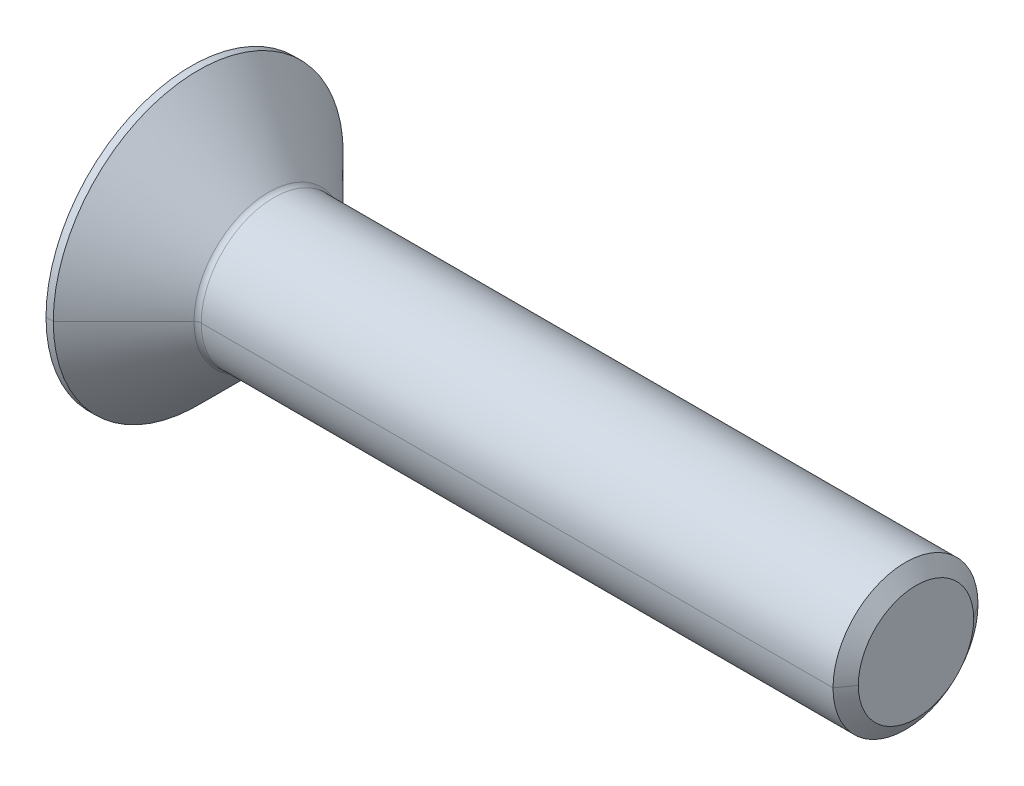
ISO-10303-21;
HEADER;
FILE_DESCRIPTION(('STEP AP214'),'2;1');
FILE_NAME('part.step','',(''),(''),'','','');
FILE_SCHEMA(('AUTOMOTIVE_DESIGN { 1 0 10303 214 1 1 1 1 }'));
ENDSEC;
DATA;
#1=APPLICATION_CONTEXT('core data for automotive mechanical design processes');
#2=APPLICATION_PROTOCOL_DEFINITION('international standard','automotive_design',2000,#1);
#3=PRODUCT_CONTEXT('',#1,'mechanical');
#4=PRODUCT('Part','Part','',(#3));
#5=PRODUCT_RELATED_PRODUCT_CATEGORY('part','',(#4));
#6=PRODUCT_DEFINITION_FORMATION('','',#4);
#7=PRODUCT_DEFINITION_CONTEXT('part definition',#1,'design');
#8=PRODUCT_DEFINITION('design','',#6,#7);
#9=PRODUCT_DEFINITION_SHAPE('','',#8);
#10=(LENGTH_UNIT() NAMED_UNIT(*) SI_UNIT(.MILLI.,.METRE.));
#11=(NAMED_UNIT(*) PLANE_ANGLE_UNIT() SI_UNIT($,.RADIAN.));
#12=(NAMED_UNIT(*) SI_UNIT($,.STERADIAN.) SOLID_ANGLE_UNIT());
#13=UNCERTAINTY_MEASURE_WITH_UNIT(LENGTH_MEASURE(1.E-05),#10,'distance_accuracy_value','');
#14=(GEOMETRIC_REPRESENTATION_CONTEXT(3) GLOBAL_UNCERTAINTY_ASSIGNED_CONTEXT((#13)) GLOBAL_UNIT_ASSIGNED_CONTEXT((#10,
#11,#12)) REPRESENTATION_CONTEXT('',''));
#15=CARTESIAN_POINT('',(0.,0.,0.));
#16=DIRECTION('',(0.,0.,1.));
#17=DIRECTION('',(1.,0.,0.));
#18=AXIS2_PLACEMENT_3D('',#15,#16,#17);
#19=CARTESIAN_POINT('',(3.060145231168,0.,0.));
#20=DIRECTION('',(-1.,0.,0.));
#21=DIRECTION('',(0.,0.,-1.));
#22=AXIS2_PLACEMENT_3D('',#19,#20,#21);
#23=CONICAL_SURFACE('',#22,1.0098,1.0471975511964);
#24=DIRECTION('',(0.500000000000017,0.,0.866025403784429));
#25=VECTOR('',#24,1.);
#26=CARTESIAN_POINT('',(2.5,0.,-1.98));
#27=LINE('',#26,#25);
#28=CARTESIAN_POINT('',(2.5,0.,-1.98));
#29=VERTEX_POINT('',#28);
#30=CARTESIAN_POINT('',(3.643153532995,0.,0.));
#31=VERTEX_POINT('',#30);
#32=EDGE_CURVE('E25',#29,#31,#27,.T.);
#33=ORIENTED_EDGE('',*,*,#32,.F.);
#34=CARTESIAN_POINT('',(2.5,0.,0.));
#35=DIRECTION('',(1.,0.,0.));
#36=DIRECTION('',(0.,0.,1.));
#37=AXIS2_PLACEMENT_3D('',#34,#35,#36);
#38=CIRCLE('',#37,1.98);
#39=CARTESIAN_POINT('',(2.5,0.,1.98));
#40=VERTEX_POINT('',#39);
#41=EDGE_CURVE('E204',#40,#29,#38,.T.);
#42=ORIENTED_EDGE('',*,*,#41,.F.);
#43=DIRECTION('',(-0.500000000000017,0.,0.866025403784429));
#44=VECTOR('',#43,1.);
#45=CARTESIAN_POINT('',(3.643153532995,0.,0.));
#46=LINE('',#45,#44);
#47=EDGE_CURVE('E11',#31,#40,#46,.T.);
#48=ORIENTED_EDGE('',*,*,#47,.F.);
#49=EDGE_LOOP('',(#33,#42,#48));
#50=FACE_BOUND('',#49,.T.);
#51=ADVANCED_FACE('F16',(#50),#23,.F.);
#52=CARTESIAN_POINT('',(3.060145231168,0.,0.));
#53=DIRECTION('',(-1.,0.,0.));
#54=DIRECTION('',(0.,0.,-1.));
#55=AXIS2_PLACEMENT_3D('',#52,#53,#54);
#56=CONICAL_SURFACE('',#55,1.0098,1.0471975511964);
#57=CARTESIAN_POINT('',(2.5,0.,0.));
#58=DIRECTION('',(1.,0.,0.));
#59=DIRECTION('',(0.,0.,-1.));
#60=AXIS2_PLACEMENT_3D('',#57,#58,#59);
#61=CIRCLE('',#60,1.98);
#62=EDGE_CURVE('E270',#29,#40,#61,.T.);
#63=ORIENTED_EDGE('',*,*,#62,.F.);
#64=ORIENTED_EDGE('',*,*,#32,.T.);
#65=ORIENTED_EDGE('',*,*,#47,.T.);
#66=EDGE_LOOP('',(#63,#64,#65));
#67=FACE_BOUND('',#66,.T.);
#68=ADVANCED_FACE('F385',(#67),#56,.F.);
#69=CARTESIAN_POINT('',(2.5,0.,0.));
#70=DIRECTION('',(1.,0.,0.));
#71=DIRECTION('',(0.,1.,0.));
#72=AXIS2_PLACEMENT_3D('',#69,#70,#71);
#73=PLANE('',#72);
#74=ORIENTED_EDGE('',*,*,#62,.T.);
#75=ORIENTED_EDGE('',*,*,#41,.T.);
#76=EDGE_LOOP('',(#74,#75));
#77=FACE_BOUND('',#76,.T.);
#78=DIRECTION('',(0.,-0.498487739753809,-0.866896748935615));
#79=VECTOR('',#78,1.);
#80=CARTESIAN_POINT('',(2.5,2.30939755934,0.004030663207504));
#81=LINE('',#80,#79);
#82=CARTESIAN_POINT('',(2.5,2.30939755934,0.004030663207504));
#83=VERTEX_POINT('',#82);
#84=CARTESIAN_POINT('',(2.5,1.158189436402,-1.997981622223));
#85=VERTEX_POINT('',#84);
#86=EDGE_CURVE('E294',#83,#85,#81,.T.);
#87=ORIENTED_EDGE('',*,*,#86,.T.);
#88=DIRECTION('',(0.,0.999998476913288,0.00174532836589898));
#89=VECTOR('',#88,1.);
#90=CARTESIAN_POINT('',(2.5,-1.151208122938,-2.00201228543));
#91=LINE('',#90,#89);
#92=CARTESIAN_POINT('',(2.5,-1.151208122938,-2.00201228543));
#93=VERTEX_POINT('',#92);
#94=EDGE_CURVE('E300',#93,#85,#91,.T.);
#95=ORIENTED_EDGE('',*,*,#94,.F.);
#96=DIRECTION('',(0.,-0.501510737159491,0.865151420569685));
#97=VECTOR('',#96,1.);
#98=CARTESIAN_POINT('',(2.5,-1.151208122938,-2.00201228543));
#99=LINE('',#98,#97);
#100=CARTESIAN_POINT('',(2.5,-2.30939755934,-0.004030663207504));
#101=VERTEX_POINT('',#100);
#102=EDGE_CURVE('E289',#93,#101,#99,.T.);
#103=ORIENTED_EDGE('',*,*,#102,.T.);
#104=DIRECTION('',(0.,0.498487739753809,0.866896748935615));
#105=VECTOR('',#104,1.);
#106=CARTESIAN_POINT('',(2.5,-2.30939755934,-0.004030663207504));
#107=LINE('',#106,#105);
#108=CARTESIAN_POINT('',(2.5,-1.158189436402,1.997981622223));
#109=VERTEX_POINT('',#108);
#110=EDGE_CURVE('E284',#101,#109,#107,.T.);
#111=ORIENTED_EDGE('',*,*,#110,.T.);
#112=DIRECTION('',(0.,-0.999998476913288,-0.00174532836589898));
#113=VECTOR('',#112,1.);
#114=CARTESIAN_POINT('',(2.5,1.151208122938,2.00201228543));
#115=LINE('',#114,#113);
#116=CARTESIAN_POINT('',(2.5,1.151208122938,2.00201228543));
#117=VERTEX_POINT('',#116);
#118=EDGE_CURVE('E279',#117,#109,#115,.T.);
#119=ORIENTED_EDGE('',*,*,#118,.F.);
#120=DIRECTION('',(0.,0.501510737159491,-0.865151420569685));
#121=VECTOR('',#120,1.);
#122=CARTESIAN_POINT('',(2.5,1.151208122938,2.00201228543));
#123=LINE('',#122,#121);
#124=EDGE_CURVE('E274',#117,#83,#123,.T.);
#125=ORIENTED_EDGE('',*,*,#124,.T.);
#126=EDGE_LOOP('',(#87,#95,#103,#111,#119,#125));
#127=FACE_BOUND('',#126,.T.);
#128=ADVANCED_FACE('F389',(#77,#127),#73,.F.);
#129=CARTESIAN_POINT('',(0.,1.151208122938,2.00201228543));
#130=DIRECTION('',(0.,0.865151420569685,0.501510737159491));
#131=DIRECTION('',(1.,0.,0.));
#132=AXIS2_PLACEMENT_3D('',#129,#130,#131);
#133=PLANE('',#132);
#134=DIRECTION('',(-1.,0.,0.));
#135=VECTOR('',#134,1.);
#136=CARTESIAN_POINT('',(2.5,2.30939755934,0.004030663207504));
#137=LINE('',#136,#135);
#138=CARTESIAN_POINT('',(0.1154700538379,2.30939755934,0.004030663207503));
#139=VERTEX_POINT('',#138);
#140=EDGE_CURVE('E298',#83,#139,#137,.T.);
#141=ORIENTED_EDGE('',*,*,#140,.F.);
#142=ORIENTED_EDGE('',*,*,#124,.F.);
#143=DIRECTION('',(-1.,0.,0.));
#144=VECTOR('',#143,1.);
#145=CARTESIAN_POINT('',(2.5,1.151208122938,2.00201228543));
#146=LINE('',#145,#144);
#147=CARTESIAN_POINT('',(0.1154700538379,1.151208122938,2.00201228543));
#148=VERTEX_POINT('',#147);
#149=EDGE_CURVE('E278',#117,#148,#146,.T.);
#150=ORIENTED_EDGE('',*,*,#149,.T.);
#151=CARTESIAN_POINT('',(0.115470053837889,2.30939755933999,0.0040306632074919));
#152=CARTESIAN_POINT('',(0.141210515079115,2.28356961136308,0.0485812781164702));
#153=CARTESIAN_POINT('',(0.165955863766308,2.25746357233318,0.0935754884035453));
#154=CARTESIAN_POINT('',(0.212028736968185,2.20575204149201,0.182695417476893));
#155=CARTESIAN_POINT('',(0.233453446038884,2.18016836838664,0.226783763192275));
#156=CARTESIAN_POINT('',(0.272900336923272,2.12937758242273,0.314363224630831));
#157=CARTESIAN_POINT('',(0.291014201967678,2.10418778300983,0.357822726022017));
#158=CARTESIAN_POINT('',(0.323835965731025,2.05402056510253,0.444434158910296));
#159=CARTESIAN_POINT('',(0.338621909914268,2.02905544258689,0.487563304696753));
#160=CARTESIAN_POINT('',(0.357878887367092,1.9923503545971,0.550897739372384));
#161=CARTESIAN_POINT('',(0.363591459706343,1.98078967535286,0.570834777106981));
#162=CARTESIAN_POINT('',(0.374247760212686,1.9577491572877,0.610545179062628));
#163=CARTESIAN_POINT('',(0.379201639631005,1.94627066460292,0.630316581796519));
#164=CARTESIAN_POINT('',(0.388338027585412,1.92338378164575,0.669742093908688));
#165=CARTESIAN_POINT('',(0.392529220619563,1.91197624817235,0.689394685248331));
#166=CARTESIAN_POINT('',(0.400142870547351,1.88921252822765,0.728625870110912));
#167=CARTESIAN_POINT('',(0.403572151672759,1.87785685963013,0.748203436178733));
#168=CARTESIAN_POINT('',(0.409663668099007,1.8551752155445,0.787327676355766));
#169=CARTESIAN_POINT('',(0.412330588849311,1.84384950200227,0.806873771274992));
#170=CARTESIAN_POINT('',(0.416899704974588,1.82120180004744,0.845976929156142));
#171=CARTESIAN_POINT('',(0.418804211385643,1.80987990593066,0.86553377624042));
#172=CARTESIAN_POINT('',(0.421850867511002,1.78720997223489,0.904699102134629));
#173=CARTESIAN_POINT('',(0.422992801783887,1.77586192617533,0.924307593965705));
#174=CARTESIAN_POINT('',(0.424517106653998,1.75310557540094,0.9636151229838));
#175=CARTESIAN_POINT('',(0.424896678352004,1.74169720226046,0.98331422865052));
#176=CARTESIAN_POINT('',(0.424898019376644,1.71886872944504,1.02269273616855));
#177=CARTESIAN_POINT('',(0.42452016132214,1.70744863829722,1.04237214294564));
#178=CARTESIAN_POINT('',(0.422998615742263,1.68465671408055,1.08163682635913));
#179=CARTESIAN_POINT('',(0.421857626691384,1.67328485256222,1.10122219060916));
#180=CARTESIAN_POINT('',(0.418812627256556,1.65057185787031,1.14034755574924));
#181=CARTESIAN_POINT('',(0.416908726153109,1.63923072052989,1.15988756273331));
#182=CARTESIAN_POINT('',(0.412340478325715,1.61655822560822,1.19896867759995));
#183=CARTESIAN_POINT('',(0.409673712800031,1.60522701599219,1.21850958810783));
#184=CARTESIAN_POINT('',(0.403582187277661,1.58255017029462,1.25763636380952));
#185=CARTESIAN_POINT('',(0.400152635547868,1.57120491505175,1.27722170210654));
#186=CARTESIAN_POINT('',(0.39253814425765,1.54847247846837,1.3164783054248));
#187=CARTESIAN_POINT('',(0.388346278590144,1.53708593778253,1.33614859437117));
#188=CARTESIAN_POINT('',(0.37920812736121,1.51424198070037,1.37561387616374));
#189=CARTESIAN_POINT('',(0.374253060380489,1.50278545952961,1.39540735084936));
#190=CARTESIAN_POINT('',(0.363594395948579,1.47976556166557,1.43515238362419));
#191=CARTESIAN_POINT('',(0.35788056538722,1.46820320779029,1.45510177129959));
#192=CARTESIAN_POINT('',(0.338627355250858,1.43148053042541,1.51842810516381));
#193=CARTESIAN_POINT('',(0.323847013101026,1.40646402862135,1.56151652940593));
#194=CARTESIAN_POINT('',(0.291032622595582,1.35624218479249,1.64808120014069));
#195=CARTESIAN_POINT('',(0.272920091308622,1.33105065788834,1.69153537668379));
#196=CARTESIAN_POINT('',(0.233472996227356,1.28029606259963,1.77913505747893));
#197=CARTESIAN_POINT('',(0.212046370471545,1.25475192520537,1.82324971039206));
#198=CARTESIAN_POINT('',(0.165966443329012,1.20311152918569,1.91242615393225));
#199=CARTESIAN_POINT('',(0.141215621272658,1.17703691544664,1.95745029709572));
#200=CARTESIAN_POINT('',(0.115470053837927,1.15120812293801,2.00201228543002));
#201=B_SPLINE_CURVE_WITH_KNOTS('',3,(#151,#152,#153,#154,#155,#156,#157,#158,#159,#160,#161,
#162,#163,#164,#165,#166,#167,#168,#169,#170,#171,#172,#173,#174,#175,#176,#177,#178,#179,#180,
#181,#182,#183,#184,#185,#186,#187,#188,#189,#190,#191,#192,#193,#194,#195,#196,#197,#198,#199,
#200),.UNSPECIFIED.,.F.,.F.,(4,2,2,2,2,2,2,2,2,2,2,2,2,2,2,2,2,2,2,2,2,2,2,2,4),(0.,
0.17273613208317,0.338555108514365,0.498670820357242,0.654510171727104,0.725733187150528,
0.795899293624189,0.865208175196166,0.933868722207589,1.00209773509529,1.07011833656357,
1.13815814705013,1.20644730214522,1.27470287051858,1.3427183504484,1.41072409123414,
1.4789478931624,1.54761302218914,1.61693638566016,1.68712694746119,1.75838443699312,
1.91419169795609,2.07429538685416,2.24012471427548,2.41289531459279),.UNSPECIFIED.);
#202=EDGE_CURVE('E217',#139,#148,#201,.T.);
#203=ORIENTED_EDGE('',*,*,#202,.F.);
#204=EDGE_LOOP('',(#141,#142,#150,#203));
#205=FACE_BOUND('',#204,.T.);
#206=ADVANCED_FACE('F334',(#205),#133,.F.);
#207=CARTESIAN_POINT('',(0.213377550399,0.,0.));
#208=DIRECTION('',(-1.,0.,0.));
#209=DIRECTION('',(0.,0.,-1.));
#210=AXIS2_PLACEMENT_3D('',#207,#208,#209);
#211=CONICAL_SURFACE('',#210,2.211493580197,0.785398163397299);
#212=CARTESIAN_POINT('',(0.4248680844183,0.,-2.000003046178));
#213=CARTESIAN_POINT('',(0.4249597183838,0.0525023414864,-1.999911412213));
#214=CARTESIAN_POINT('',(0.4209923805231,0.1577455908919,-1.999727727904));
#215=CARTESIAN_POINT('',(0.402657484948,0.3158357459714,-1.999451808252));
#216=CARTESIAN_POINT('',(0.3718845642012,0.4756221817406,-1.999172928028));
#217=CARTESIAN_POINT('',(0.3287264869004,0.6374714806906,-1.998890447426));
#218=CARTESIAN_POINT('',(0.2727299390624,0.8034092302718,-1.998600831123));
#219=CARTESIAN_POINT('',(0.2031200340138,0.9753855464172,-1.998300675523));
#220=CARTESIAN_POINT('',(0.1463878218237,1.096353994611,-1.998089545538));
#221=CARTESIAN_POINT('',(0.1154700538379,1.158189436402,-1.997981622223));
#222=(BOUNDED_CURVE() B_SPLINE_CURVE(3,(#212,#213,#214,#215,#216,#217,#218,#219,#220,#221),
.UNSPECIFIED.,.F.,.F.) B_SPLINE_CURVE_WITH_KNOTS((4,1,1,1,1,1,1,4),(0.,0.1428571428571,
0.2857142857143,0.4285714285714,0.5714285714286,0.7142857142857,0.8571428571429,1.),
.UNSPECIFIED.) CURVE() GEOMETRIC_REPRESENTATION_ITEM() RATIONAL_B_SPLINE_CURVE((1.,1.,1.,1.,1.,
1.,1.,1.,1.,1.)) REPRESENTATION_ITEM(''));
#223=CARTESIAN_POINT('',(0.4248680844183,0.,-2.000003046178));
#224=VERTEX_POINT('',#223);
#225=CARTESIAN_POINT('',(0.1154700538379,1.158189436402,-1.997981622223));
#226=VERTEX_POINT('',#225);
#227=EDGE_CURVE('E303',#224,#226,#222,.T.);
#228=ORIENTED_EDGE('',*,*,#227,.T.);
#229=CARTESIAN_POINT('',(0.115470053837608,1.15818943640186,-1.99798162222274));
#230=CARTESIAN_POINT('',(0.14121051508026,1.18385742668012,-1.9533386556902));
#231=CARTESIAN_POINT('',(0.165955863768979,1.20977053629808,-1.90823305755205));
#232=CARTESIAN_POINT('',(0.212028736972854,1.2610948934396,-1.81888959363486));
#233=CARTESIAN_POINT('',(0.233453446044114,1.28648468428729,-1.7746893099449));
#234=CARTESIAN_POINT('',(0.272900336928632,1.33693532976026,-1.68691346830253));
#235=CARTESIAN_POINT('',(0.29101420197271,1.3619774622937,-1.64336871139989));
#236=CARTESIAN_POINT('',(0.323835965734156,1.41190155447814,-1.55661690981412));
#237=CARTESIAN_POINT('',(0.338621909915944,1.43676992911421,-1.51343190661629));
#238=CARTESIAN_POINT('',(0.357878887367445,1.47326661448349,-1.44997715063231));
#239=CARTESIAN_POINT('',(0.363591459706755,1.48475225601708,-1.42999678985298));
#240=CARTESIAN_POINT('',(0.374247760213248,1.50762221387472,-1.3901879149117));
#241=CARTESIAN_POINT('',(0.379201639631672,1.51900550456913,-1.37036154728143));
#242=CARTESIAN_POINT('',(0.388338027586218,1.54170555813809,-1.3308281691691));
#243=CARTESIAN_POINT('',(0.392529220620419,1.55302143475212,-1.31112265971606));
#244=CARTESIAN_POINT('',(0.400142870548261,1.57561477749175,-1.27179310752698));
#245=CARTESIAN_POINT('',(0.403572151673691,1.58689161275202,-1.25217002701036));
#246=CARTESIAN_POINT('',(0.409663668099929,1.60943337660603,-1.21296502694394));
#247=CARTESIAN_POINT('',(0.41233058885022,1.62069793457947,-1.19338362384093));
#248=CARTESIAN_POINT('',(0.416899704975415,1.6432384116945,-1.15421855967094));
#249=CARTESIAN_POINT('',(0.41880421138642,1.65451419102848,-1.13463508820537));
#250=CARTESIAN_POINT('',(0.421850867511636,1.67709739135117,-1.09541968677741));
#251=CARTESIAN_POINT('',(0.422992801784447,1.68840482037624,-1.07578774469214));
#252=CARTESIAN_POINT('',(0.424517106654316,1.71106796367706,-1.0364264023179));
#253=CARTESIAN_POINT('',(0.424896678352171,1.72242370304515,-1.01669690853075));
#254=CARTESIAN_POINT('',(0.424898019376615,1.74511225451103,-0.977237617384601));
#255=CARTESIAN_POINT('',(0.424520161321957,1.75644507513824,-0.957507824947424));
#256=CARTESIAN_POINT('',(0.422998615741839,1.77905332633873,-0.918137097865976));
#257=CARTESIAN_POINT('',(0.421857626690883,1.79032881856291,-0.898496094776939));
#258=CARTESIAN_POINT('',(0.418812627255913,1.81285588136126,-0.859263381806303));
#259=CARTESIAN_POINT('',(0.416908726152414,1.8241074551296,-0.839671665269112));
#260=CARTESIAN_POINT('',(0.412340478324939,1.84661644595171,-0.800496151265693));
#261=CARTESIAN_POINT('',(0.409673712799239,1.8578737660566,-0.780912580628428));
#262=CARTESIAN_POINT('',(0.40358218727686,1.8804201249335,-0.74171046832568));
#263=CARTESIAN_POINT('',(0.400152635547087,1.89170889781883,-0.722092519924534));
#264=CARTESIAN_POINT('',(0.392538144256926,1.91433989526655,-0.682777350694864));
#265=CARTESIAN_POINT('',(0.38834627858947,1.92568159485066,-0.663081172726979));
#266=CARTESIAN_POINT('',(0.379208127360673,1.94843755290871,-0.623565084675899));
#267=CARTESIAN_POINT('',(0.374253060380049,1.95985094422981,-0.603746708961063));
#268=CARTESIAN_POINT('',(0.36359439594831,1.98276120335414,-0.563938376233));
#269=CARTESIAN_POINT('',(0.357880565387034,1.99425670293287,-0.543950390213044));
#270=CARTESIAN_POINT('',(0.338627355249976,2.03073757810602,-0.480484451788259));
#271=CARTESIAN_POINT('',(0.323847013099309,2.05554499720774,-0.437275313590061));
#272=CARTESIAN_POINT('',(0.291032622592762,2.10540127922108,-0.35049958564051));
#273=CARTESIAN_POINT('',(0.272920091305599,2.13043793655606,-0.306955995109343));
#274=CARTESIAN_POINT('',(0.233472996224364,2.18092418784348,-0.219201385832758));
#275=CARTESIAN_POINT('',(0.212046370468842,2.20635652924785,-0.1750221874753));
#276=CARTESIAN_POINT('',(0.165966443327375,2.25776539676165,-0.0857120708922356));
#277=CARTESIAN_POINT('',(0.141215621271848,2.28372014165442,-0.0406187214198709));
#278=CARTESIAN_POINT('',(0.115470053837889,2.30939755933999,0.0040306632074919));
#279=B_SPLINE_CURVE_WITH_KNOTS('',3,(#229,#230,#231,#232,#233,#234,#235,#236,#237,#238,#239,
#240,#241,#242,#243,#244,#245,#246,#247,#248,#249,#250,#251,#252,#253,#254,#255,#256,#257,#258,
#259,#260,#261,#262,#263,#264,#265,#266,#267,#268,#269,#270,#271,#272,#273,#274,#275,#276,#277,
#278),.UNSPECIFIED.,.F.,.F.,(4,2,2,2,2,2,2,2,2,2,2,2,2,2,2,2,2,2,2,2,2,2,2,2,4),(0.,
0.172736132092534,0.338555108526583,0.498670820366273,0.654510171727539,0.725733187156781,
0.795899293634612,0.865208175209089,0.933868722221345,1.00209773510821,1.07011833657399,
1.1381581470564,1.20644730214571,1.27470287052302,1.3427183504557,1.41072409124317,
1.47894789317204,1.54761302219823,1.61693638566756,1.68712694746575,1.7583844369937,
1.91419169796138,2.07429538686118,2.24012471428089,2.41289531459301),.UNSPECIFIED.);
#280=EDGE_CURVE('E304',#226,#139,#279,.T.);
#281=ORIENTED_EDGE('',*,*,#280,.T.);
#282=ORIENTED_EDGE('',*,*,#202,.T.);
#283=CARTESIAN_POINT('',(0.1154700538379,1.151208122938,2.00201228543));
#284=CARTESIAN_POINT('',(0.146194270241,1.089759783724,2.001905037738));
#285=CARTESIAN_POINT('',(0.2026006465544,0.9695372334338,2.001695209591));
#286=CARTESIAN_POINT('',(0.271908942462,0.79857165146,2.001396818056));
#287=CARTESIAN_POINT('',(0.327760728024,0.6335959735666,2.001108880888));
#288=CARTESIAN_POINT('',(0.3709207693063,0.4727049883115,2.000828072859));
#289=CARTESIAN_POINT('',(0.4018504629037,0.313871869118,2.000550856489));
#290=CARTESIAN_POINT('',(0.42049627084,0.1567494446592,2.000276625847));
#291=CARTESIAN_POINT('',(0.4247770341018,0.05216793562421,2.000094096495));
#292=CARTESIAN_POINT('',(0.4248680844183,0.,2.000003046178));
#293=(BOUNDED_CURVE() B_SPLINE_CURVE(3,(#283,#284,#285,#286,#287,#288,#289,#290,#291,#292),
.UNSPECIFIED.,.F.,.F.) B_SPLINE_CURVE_WITH_KNOTS((4,1,1,1,1,1,1,4),(0.,0.1428571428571,
0.2857142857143,0.4285714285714,0.5714285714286,0.7142857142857,0.8571428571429,1.),
.UNSPECIFIED.) CURVE() GEOMETRIC_REPRESENTATION_ITEM() RATIONAL_B_SPLINE_CURVE((1.,1.,1.,1.,1.,
1.,1.,1.,1.,1.)) REPRESENTATION_ITEM(''));
#294=CARTESIAN_POINT('',(0.4248680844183,0.,2.000003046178));
#295=VERTEX_POINT('',#294);
#296=EDGE_CURVE('E288',#148,#295,#293,.T.);
#297=ORIENTED_EDGE('',*,*,#296,.T.);
#298=DIRECTION('',(-0.707106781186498,0.,0.707106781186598));
#299=VECTOR('',#298,1.);
#300=CARTESIAN_POINT('',(0.4248680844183,0.,2.000003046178));
#301=LINE('',#300,#299);
#302=CARTESIAN_POINT('',(0.,0.,2.424871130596));
#303=VERTEX_POINT('',#302);
#304=EDGE_CURVE('E218',#295,#303,#301,.T.);
#305=ORIENTED_EDGE('',*,*,#304,.T.);
#306=CARTESIAN_POINT('',(0.,0.,0.));
#307=DIRECTION('',(1.,0.,0.));
#308=DIRECTION('',(0.,0.,-1.));
#309=AXIS2_PLACEMENT_3D('',#306,#307,#308);
#310=CIRCLE('',#309,2.424871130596);
#311=CARTESIAN_POINT('',(0.,0.,-2.424871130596));
#312=VERTEX_POINT('',#311);
#313=EDGE_CURVE('E205',#312,#303,#310,.T.);
#314=ORIENTED_EDGE('',*,*,#313,.F.);
#315=DIRECTION('',(0.707106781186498,0.,0.707106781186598));
#316=VECTOR('',#315,1.);
#317=CARTESIAN_POINT('',(0.,0.,-2.424871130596));
#318=LINE('',#317,#316);
#319=EDGE_CURVE('E214',#312,#224,#318,.T.);
#320=ORIENTED_EDGE('',*,*,#319,.T.);
#321=EDGE_LOOP('',(#228,#281,#282,#297,#305,#314,#320));
#322=FACE_BOUND('',#321,.T.);
#323=ADVANCED_FACE('F323',(#322),#211,.F.);
#324=CARTESIAN_POINT('',(0.213377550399,0.,0.));
#325=DIRECTION('',(-1.,0.,0.));
#326=DIRECTION('',(0.,0.,-1.));
#327=AXIS2_PLACEMENT_3D('',#324,#325,#326);
#328=CONICAL_SURFACE('',#327,2.211493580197,0.785398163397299);
#329=CARTESIAN_POINT('',(0.,0.,0.));
#330=DIRECTION('',(1.,0.,0.));
#331=DIRECTION('',(0.,0.,1.));
#332=AXIS2_PLACEMENT_3D('',#329,#330,#331);
#333=CIRCLE('',#332,2.424871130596);
#334=EDGE_CURVE('E208',#303,#312,#333,.T.);
#335=ORIENTED_EDGE('',*,*,#334,.F.);
#336=ORIENTED_EDGE('',*,*,#304,.F.);
#337=CARTESIAN_POINT('',(0.4248680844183,0.,2.000003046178));
#338=CARTESIAN_POINT('',(0.4249597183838,-0.0525023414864,1.999911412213));
#339=CARTESIAN_POINT('',(0.4209923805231,-0.1577455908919,1.999727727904));
#340=CARTESIAN_POINT('',(0.402657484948,-0.3158357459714,1.999451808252));
#341=CARTESIAN_POINT('',(0.3718845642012,-0.4756221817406,1.999172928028));
#342=CARTESIAN_POINT('',(0.3287264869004,-0.6374714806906,1.998890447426));
#343=CARTESIAN_POINT('',(0.2727299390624,-0.8034092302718,1.998600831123));
#344=CARTESIAN_POINT('',(0.2031200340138,-0.9753855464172,1.998300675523));
#345=CARTESIAN_POINT('',(0.1463878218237,-1.096353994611,1.998089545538));
#346=CARTESIAN_POINT('',(0.1154700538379,-1.158189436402,1.997981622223));
#347=(BOUNDED_CURVE() B_SPLINE_CURVE(3,(#337,#338,#339,#340,#341,#342,#343,#344,#345,#346),
.UNSPECIFIED.,.F.,.F.) B_SPLINE_CURVE_WITH_KNOTS((4,1,1,1,1,1,1,4),(0.,0.1428571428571,
0.2857142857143,0.4285714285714,0.5714285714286,0.7142857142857,0.8571428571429,1.),
.UNSPECIFIED.) CURVE() GEOMETRIC_REPRESENTATION_ITEM() RATIONAL_B_SPLINE_CURVE((1.,1.,1.,1.,1.,
1.,1.,1.,1.,1.)) REPRESENTATION_ITEM(''));
#348=CARTESIAN_POINT('',(0.1154700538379,-1.158189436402,1.997981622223));
#349=VERTEX_POINT('',#348);
#350=EDGE_CURVE('E831',#295,#349,#347,.T.);
#351=ORIENTED_EDGE('',*,*,#350,.T.);
#352=CARTESIAN_POINT('',(0.115470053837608,-1.15818943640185,1.99798162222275));
#353=CARTESIAN_POINT('',(0.141210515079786,-1.18385742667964,1.95333865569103));
#354=CARTESIAN_POINT('',(0.165955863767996,-1.20977053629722,1.90823305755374));
#355=CARTESIAN_POINT('',(0.21202873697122,-1.26109489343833,1.81888959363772));
#356=CARTESIAN_POINT('',(0.233453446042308,-1.28648468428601,1.77468930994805));
#357=CARTESIAN_POINT('',(0.272900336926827,-1.33693532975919,1.68691346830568));
#358=CARTESIAN_POINT('',(0.291014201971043,-1.36197746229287,1.64336871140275));
#359=CARTESIAN_POINT('',(0.323835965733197,-1.41190155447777,1.55661690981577));
#360=CARTESIAN_POINT('',(0.338621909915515,-1.43676992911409,1.51343190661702));
#361=CARTESIAN_POINT('',(0.357878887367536,-1.47326661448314,1.44997715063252));
#362=CARTESIAN_POINT('',(0.363591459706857,-1.48475225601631,1.42999678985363));
#363=CARTESIAN_POINT('',(0.37424776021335,-1.50762221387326,1.39018791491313));
#364=CARTESIAN_POINT('',(0.379201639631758,-1.51900550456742,1.3703615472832));
#365=CARTESIAN_POINT('',(0.388338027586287,-1.54170555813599,1.33082816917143));
#366=CARTESIAN_POINT('',(0.39252922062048,-1.55302143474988,1.31112265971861));
#367=CARTESIAN_POINT('',(0.400142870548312,-1.57561477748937,1.27179310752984));
#368=CARTESIAN_POINT('',(0.403572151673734,-1.58689161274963,1.25217002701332));
#369=CARTESIAN_POINT('',(0.409663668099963,-1.60943337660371,1.21296502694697));
#370=CARTESIAN_POINT('',(0.412330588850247,-1.62069793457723,1.19338362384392));
#371=CARTESIAN_POINT('',(0.416899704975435,-1.64323841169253,1.15421855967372));
#372=CARTESIAN_POINT('',(0.418804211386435,-1.65451419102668,1.13463508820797));
#373=CARTESIAN_POINT('',(0.421850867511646,-1.67709739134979,1.09541968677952));
#374=CARTESIAN_POINT('',(0.42299280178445,-1.68840482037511,1.07578774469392));
#375=CARTESIAN_POINT('',(0.424517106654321,-1.71106796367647,1.03642640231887));
#376=CARTESIAN_POINT('',(0.424896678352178,-1.72242370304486,1.01669690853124));
#377=CARTESIAN_POINT('',(0.424898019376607,-1.74511225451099,0.977237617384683));
#378=CARTESIAN_POINT('',(0.424520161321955,-1.75644507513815,0.957507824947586));
#379=CARTESIAN_POINT('',(0.42299861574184,-1.77905332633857,0.918137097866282));
#380=CARTESIAN_POINT('',(0.421857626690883,-1.79032881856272,0.898496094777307));
#381=CARTESIAN_POINT('',(0.418812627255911,-1.81285588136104,0.859263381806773));
#382=CARTESIAN_POINT('',(0.416908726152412,-1.82410745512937,0.839671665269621));
#383=CARTESIAN_POINT('',(0.412340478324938,-1.84661644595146,0.800496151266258));
#384=CARTESIAN_POINT('',(0.409673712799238,-1.85787376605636,0.780912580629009));
#385=CARTESIAN_POINT('',(0.403582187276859,-1.88042012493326,0.74171046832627));
#386=CARTESIAN_POINT('',(0.400152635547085,-1.89170889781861,0.722092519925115));
#387=CARTESIAN_POINT('',(0.392538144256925,-1.91433989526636,0.682777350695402));
#388=CARTESIAN_POINT('',(0.388346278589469,-1.92568159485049,0.663081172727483));
#389=CARTESIAN_POINT('',(0.379208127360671,-1.94843755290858,0.623565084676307));
#390=CARTESIAN_POINT('',(0.374253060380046,-1.95985094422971,0.603746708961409));
#391=CARTESIAN_POINT('',(0.36359439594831,-1.98276120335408,0.563938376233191));
#392=CARTESIAN_POINT('',(0.357880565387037,-1.99425670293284,0.543950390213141));
#393=CARTESIAN_POINT('',(0.338627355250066,-2.03073757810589,0.480484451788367));
#394=CARTESIAN_POINT('',(0.323847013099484,-2.05554499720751,0.437275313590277));
#395=CARTESIAN_POINT('',(0.29103262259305,-2.10540127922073,0.350499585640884));
#396=CARTESIAN_POINT('',(0.272920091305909,-2.13043793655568,0.30695599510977));
#397=CARTESIAN_POINT('',(0.23347299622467,-2.18092418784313,0.219201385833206));
#398=CARTESIAN_POINT('',(0.212046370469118,-2.20635652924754,0.175022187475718));
#399=CARTESIAN_POINT('',(0.165966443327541,-2.25776539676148,0.0857120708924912));
#400=CARTESIAN_POINT('',(0.141215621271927,-2.28372014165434,0.0406187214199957));
#401=CARTESIAN_POINT('',(0.115470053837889,-2.30939755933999,-0.00403066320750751));
#402=B_SPLINE_CURVE_WITH_KNOTS('',3,(#352,#353,#354,#355,#356,#357,#358,#359,#360,#361,#362,
#363,#364,#365,#366,#367,#368,#369,#370,#371,#372,#373,#374,#375,#376,#377,#378,#379,#380,#381,
#382,#383,#384,#385,#386,#387,#388,#389,#390,#391,#392,#393,#394,#395,#396,#397,#398,#399,#400,
#401),.UNSPECIFIED.,.F.,.F.,(4,2,2,2,2,2,2,2,2,2,2,2,2,2,2,2,2,2,2,2,2,2,2,2,4),(0.,
0.172736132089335,0.338555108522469,0.498670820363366,0.654510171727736,0.725733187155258,
0.795899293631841,0.865208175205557,0.933868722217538,1.00209773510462,1.07011833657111,
1.13815814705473,1.20644730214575,1.27470287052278,1.34271835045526,1.41072409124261,
1.47894789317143,1.54761302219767,1.61693638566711,1.68712694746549,1.75838443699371,
1.9141916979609,2.07429538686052,2.2401247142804,2.41289531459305),.UNSPECIFIED.);
#403=CARTESIAN_POINT('',(0.1154700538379,-2.30939755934,-0.004030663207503));
#404=VERTEX_POINT('',#403);
#405=EDGE_CURVE('E293',#349,#404,#402,.T.);
#406=ORIENTED_EDGE('',*,*,#405,.T.);
#407=CARTESIAN_POINT('',(0.115470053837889,-2.30939755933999,-0.00403066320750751));
#408=CARTESIAN_POINT('',(0.141210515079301,-2.28356961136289,-0.0485812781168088));
#409=CARTESIAN_POINT('',(0.165955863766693,-2.25746357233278,-0.0935754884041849));
#410=CARTESIAN_POINT('',(0.212028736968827,-2.20575204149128,-0.182695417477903));
#411=CARTESIAN_POINT('',(0.233453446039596,-2.18016836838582,-0.22678376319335));
#412=CARTESIAN_POINT('',(0.272900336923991,-2.12937758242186,-0.314363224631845));
#413=CARTESIAN_POINT('',(0.291014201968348,-2.104187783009,-0.3578227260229));
#414=CARTESIAN_POINT('',(0.323835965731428,-2.054020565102,-0.4444341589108));
#415=CARTESIAN_POINT('',(0.33862190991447,-2.02905544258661,-0.487563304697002));
#416=CARTESIAN_POINT('',(0.35787888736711,-1.99235035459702,-0.55089773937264));
#417=CARTESIAN_POINT('',(0.363591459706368,-1.98078967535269,-0.570834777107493));
#418=CARTESIAN_POINT('',(0.374247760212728,-1.95774915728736,-0.610545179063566));
#419=CARTESIAN_POINT('',(0.379201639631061,-1.94627066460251,-0.630316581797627));
#420=CARTESIAN_POINT('',(0.388338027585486,-1.9233837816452,-0.66974209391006));
#421=CARTESIAN_POINT('',(0.392529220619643,-1.91197624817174,-0.689394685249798));
#422=CARTESIAN_POINT('',(0.400142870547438,-1.88921252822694,-0.728625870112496));
#423=CARTESIAN_POINT('',(0.40357215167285,-1.87785685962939,-0.748203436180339));
#424=CARTESIAN_POINT('',(0.409663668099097,-1.85517521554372,-0.78732767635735));
#425=CARTESIAN_POINT('',(0.412330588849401,-1.84384950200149,-0.806873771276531));
#426=CARTESIAN_POINT('',(0.41689970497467,-1.8212018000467,-0.845976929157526));
#427=CARTESIAN_POINT('',(0.41880421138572,-1.80987990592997,-0.865533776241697));
#428=CARTESIAN_POINT('',(0.421850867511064,-1.78720997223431,-0.904699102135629));
#429=CARTESIAN_POINT('',(0.422992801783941,-1.77586192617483,-0.924307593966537));
#430=CARTESIAN_POINT('',(0.424517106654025,-1.75310557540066,-0.963615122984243));
#431=CARTESIAN_POINT('',(0.424896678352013,-1.74169720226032,-0.983314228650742));
#432=CARTESIAN_POINT('',(0.424898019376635,-1.71886872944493,-1.02269273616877));
#433=CARTESIAN_POINT('',(0.424520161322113,-1.70744863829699,-1.04237214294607));
#434=CARTESIAN_POINT('',(0.422998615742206,-1.6846567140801,-1.08163682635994));
#435=CARTESIAN_POINT('',(0.421857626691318,-1.67328485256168,-1.10122219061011));
#436=CARTESIAN_POINT('',(0.41881262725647,-1.6505718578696,-1.14034755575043));
#437=CARTESIAN_POINT('',(0.416908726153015,-1.6392307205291,-1.15988756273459));
#438=CARTESIAN_POINT('',(0.412340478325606,-1.61655822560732,-1.19896867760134));
#439=CARTESIAN_POINT('',(0.409673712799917,-1.60522701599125,-1.21850958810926));
#440=CARTESIAN_POINT('',(0.403582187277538,-1.58255017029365,-1.25763636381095));
#441=CARTESIAN_POINT('',(0.400152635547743,-1.57120491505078,-1.27722170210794));
#442=CARTESIAN_POINT('',(0.39253814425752,-1.54847247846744,-1.31647830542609));
#443=CARTESIAN_POINT('',(0.388346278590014,-1.53708593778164,-1.33614859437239));
#444=CARTESIAN_POINT('',(0.379208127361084,-1.51424198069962,-1.37561387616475));
#445=CARTESIAN_POINT('',(0.374253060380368,-1.50278545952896,-1.39540735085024));
#446=CARTESIAN_POINT('',(0.36359439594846,-1.47976556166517,-1.43515238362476));
#447=CARTESIAN_POINT('',(0.357880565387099,-1.46820320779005,-1.45510177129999));
#448=CARTESIAN_POINT('',(0.33862735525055,-1.43148053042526,-1.51842810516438));
#449=CARTESIAN_POINT('',(0.323847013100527,-1.40646402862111,-1.56151652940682));
#450=CARTESIAN_POINT('',(0.291032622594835,-1.35624218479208,-1.64808120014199));
#451=CARTESIAN_POINT('',(0.272920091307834,-1.33105065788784,-1.69153537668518));
#452=CARTESIAN_POINT('',(0.233472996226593,-1.28029606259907,-1.77913505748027));
#453=CARTESIAN_POINT('',(0.212046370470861,-1.25475192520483,-1.82324971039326));
#454=CARTESIAN_POINT('',(0.165966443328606,-1.20311152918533,-1.91242615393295));
#455=CARTESIAN_POINT('',(0.141215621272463,-1.17703691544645,-1.95745029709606));
#456=CARTESIAN_POINT('',(0.115470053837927,-1.15120812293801,-2.00201228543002));
#457=B_SPLINE_CURVE_WITH_KNOTS('',3,(#407,#408,#409,#410,#411,#412,#413,#414,#415,#416,#417,
#418,#419,#420,#421,#422,#423,#424,#425,#426,#427,#428,#429,#430,#431,#432,#433,#434,#435,#436,
#437,#438,#439,#440,#441,#442,#443,#444,#445,#446,#447,#448,#449,#450,#451,#452,#453,#454,#455,
#456),.UNSPECIFIED.,.F.,.F.,(4,2,2,2,2,2,2,2,2,2,2,2,2,2,2,2,2,2,2,2,2,2,2,2,4),(0.,
0.172736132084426,0.338555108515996,0.498670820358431,0.654510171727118,0.725733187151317,
0.795899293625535,0.865208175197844,0.933868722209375,1.00209773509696,1.0701183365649,
1.1381581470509,1.20644730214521,1.27470287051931,1.34271835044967,1.41072409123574,
1.47894789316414,1.54761302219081,1.61693638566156,1.68712694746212,1.75838443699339,
1.91419169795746,2.07429538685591,2.24012471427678,2.41289531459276),.UNSPECIFIED.);
#458=CARTESIAN_POINT('',(0.1154700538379,-1.151208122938,-2.00201228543));
#459=VERTEX_POINT('',#458);
#460=EDGE_CURVE('E398',#404,#459,#457,.T.);
#461=ORIENTED_EDGE('',*,*,#460,.T.);
#462=CARTESIAN_POINT('',(0.1154700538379,-1.151208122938,-2.00201228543));
#463=CARTESIAN_POINT('',(0.146194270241,-1.089759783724,-2.001905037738));
#464=CARTESIAN_POINT('',(0.2026006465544,-0.9695372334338,-2.001695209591));
#465=CARTESIAN_POINT('',(0.271908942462,-0.79857165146,-2.001396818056));
#466=CARTESIAN_POINT('',(0.327760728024,-0.6335959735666,-2.001108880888));
#467=CARTESIAN_POINT('',(0.3709207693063,-0.4727049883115,-2.000828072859));
#468=CARTESIAN_POINT('',(0.4018504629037,-0.313871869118,-2.000550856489));
#469=CARTESIAN_POINT('',(0.42049627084,-0.1567494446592,-2.000276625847));
#470=CARTESIAN_POINT('',(0.4247770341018,-0.05216793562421,-2.000094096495));
#471=CARTESIAN_POINT('',(0.4248680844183,0.,-2.000003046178));
#472=(BOUNDED_CURVE() B_SPLINE_CURVE(3,(#462,#463,#464,#465,#466,#467,#468,#469,#470,#471),
.UNSPECIFIED.,.F.,.F.) B_SPLINE_CURVE_WITH_KNOTS((4,1,1,1,1,1,1,4),(0.,0.1428571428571,
0.2857142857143,0.4285714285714,0.5714285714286,0.7142857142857,0.8571428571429,1.),
.UNSPECIFIED.) CURVE() GEOMETRIC_REPRESENTATION_ITEM() RATIONAL_B_SPLINE_CURVE((1.,1.,1.,1.,1.,
1.,1.,1.,1.,1.)) REPRESENTATION_ITEM(''));
#473=EDGE_CURVE('E307',#459,#224,#472,.T.);
#474=ORIENTED_EDGE('',*,*,#473,.T.);
#475=ORIENTED_EDGE('',*,*,#319,.F.);
#476=EDGE_LOOP('',(#335,#336,#351,#406,#461,#474,#475));
#477=FACE_BOUND('',#476,.T.);
#478=ADVANCED_FACE('F333',(#477),#328,.F.);
#479=CARTESIAN_POINT('',(0.,1.158189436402,-1.997981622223));
#480=DIRECTION('',(0.,0.00174532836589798,-0.999998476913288));
#481=DIRECTION('',(-1.,0.,0.));
#482=AXIS2_PLACEMENT_3D('',#479,#480,#481);
#483=PLANE('',#482);
#484=DIRECTION('',(-1.,0.,0.));
#485=VECTOR('',#484,1.);
#486=CARTESIAN_POINT('',(2.5,-1.151208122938,-2.00201228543));
#487=LINE('',#486,#485);
#488=EDGE_CURVE('E292',#93,#459,#487,.T.);
#489=ORIENTED_EDGE('',*,*,#488,.F.);
#490=ORIENTED_EDGE('',*,*,#94,.T.);
#491=DIRECTION('',(-1.,0.,0.));
#492=VECTOR('',#491,1.);
#493=CARTESIAN_POINT('',(2.5,1.158189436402,-1.997981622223));
#494=LINE('',#493,#492);
#495=EDGE_CURVE('E299',#85,#226,#494,.T.);
#496=ORIENTED_EDGE('',*,*,#495,.T.);
#497=ORIENTED_EDGE('',*,*,#227,.F.);
#498=ORIENTED_EDGE('',*,*,#473,.F.);
#499=EDGE_LOOP('',(#489,#490,#496,#497,#498));
#500=FACE_BOUND('',#499,.T.);
#501=ADVANCED_FACE('F372',(#500),#483,.F.);
#502=CARTESIAN_POINT('',(0.,2.30939755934,0.004030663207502));
#503=DIRECTION('',(0.,0.866896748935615,-0.498487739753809));
#504=DIRECTION('',(-1.,0.,0.));
#505=AXIS2_PLACEMENT_3D('',#502,#503,#504);
#506=PLANE('',#505);
#507=ORIENTED_EDGE('',*,*,#495,.F.);
#508=ORIENTED_EDGE('',*,*,#86,.F.);
#509=ORIENTED_EDGE('',*,*,#140,.T.);
#510=ORIENTED_EDGE('',*,*,#280,.F.);
#511=EDGE_LOOP('',(#507,#508,#509,#510));
#512=FACE_BOUND('',#511,.T.);
#513=ADVANCED_FACE('F362',(#512),#506,.F.);
#514=CARTESIAN_POINT('',(0.,-1.151208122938,-2.00201228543));
#515=DIRECTION('',(0.,-0.865151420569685,-0.501510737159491));
#516=DIRECTION('',(0.,0.501510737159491,-0.865151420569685));
#517=AXIS2_PLACEMENT_3D('',#514,#515,#516);
#518=PLANE('',#517);
#519=DIRECTION('',(-1.,0.,0.));
#520=VECTOR('',#519,1.);
#521=CARTESIAN_POINT('',(2.5,-2.30939755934,-0.004030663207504));
#522=LINE('',#521,#520);
#523=EDGE_CURVE('E287',#101,#404,#522,.T.);
#524=ORIENTED_EDGE('',*,*,#523,.F.);
#525=ORIENTED_EDGE('',*,*,#102,.F.);
#526=ORIENTED_EDGE('',*,*,#488,.T.);
#527=ORIENTED_EDGE('',*,*,#460,.F.);
#528=EDGE_LOOP('',(#524,#525,#526,#527));
#529=FACE_BOUND('',#528,.T.);
#530=ADVANCED_FACE('F371',(#529),#518,.F.);
#531=CARTESIAN_POINT('',(0.,-2.30939755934,-0.004030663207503));
#532=DIRECTION('',(0.,-0.866896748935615,0.498487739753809));
#533=DIRECTION('',(-1.,0.,0.));
#534=AXIS2_PLACEMENT_3D('',#531,#532,#533);
#535=PLANE('',#534);
#536=DIRECTION('',(-1.,0.,0.));
#537=VECTOR('',#536,1.);
#538=CARTESIAN_POINT('',(2.5,-1.158189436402,1.997981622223));
#539=LINE('',#538,#537);
#540=EDGE_CURVE('E283',#109,#349,#539,.T.);
#541=ORIENTED_EDGE('',*,*,#540,.F.);
#542=ORIENTED_EDGE('',*,*,#110,.F.);
#543=ORIENTED_EDGE('',*,*,#523,.T.);
#544=ORIENTED_EDGE('',*,*,#405,.F.);
#545=EDGE_LOOP('',(#541,#542,#543,#544));
#546=FACE_BOUND('',#545,.T.);
#547=ADVANCED_FACE('F373',(#546),#535,.F.);
#548=CARTESIAN_POINT('',(0.,-1.158189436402,1.997981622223));
#549=DIRECTION('',(0.,-0.00174532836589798,0.999998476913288));
#550=DIRECTION('',(-1.,0.,0.));
#551=AXIS2_PLACEMENT_3D('',#548,#549,#550);
#552=PLANE('',#551);
#553=ORIENTED_EDGE('',*,*,#149,.F.);
#554=ORIENTED_EDGE('',*,*,#118,.T.);
#555=ORIENTED_EDGE('',*,*,#540,.T.);
#556=ORIENTED_EDGE('',*,*,#350,.F.);
#557=ORIENTED_EDGE('',*,*,#296,.F.);
#558=EDGE_LOOP('',(#553,#554,#555,#556,#557));
#559=FACE_BOUND('',#558,.T.);
#560=ADVANCED_FACE('F456',(#559),#552,.F.);
#561=CARTESIAN_POINT('',(0.,0.,-4.212435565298));
#562=DIRECTION('',(-1.,0.,0.));
#563=DIRECTION('',(0.,0.,1.));
#564=AXIS2_PLACEMENT_3D('',#561,#562,#563);
#565=PLANE('',#564);
#566=ORIENTED_EDGE('',*,*,#313,.T.);
#567=ORIENTED_EDGE('',*,*,#334,.T.);
#568=EDGE_LOOP('',(#566,#567));
#569=FACE_BOUND('',#568,.T.);
#570=CARTESIAN_POINT('',(0.,0.,0.));
#571=DIRECTION('',(-1.,0.,0.));
#572=DIRECTION('',(0.,0.,1.));
#573=AXIS2_PLACEMENT_3D('',#570,#571,#572);
#574=CIRCLE('',#573,6.);
#575=CARTESIAN_POINT('',(0.,0.,6.));
#576=VERTEX_POINT('',#575);
#577=CARTESIAN_POINT('',(0.,0.,-6.));
#578=VERTEX_POINT('',#577);
#579=EDGE_CURVE('E257',#576,#578,#574,.T.);
#580=ORIENTED_EDGE('',*,*,#579,.T.);
#581=CARTESIAN_POINT('',(0.,0.,0.));
#582=DIRECTION('',(-1.,0.,0.));
#583=DIRECTION('',(0.,0.,-1.));
#584=AXIS2_PLACEMENT_3D('',#581,#582,#583);
#585=CIRCLE('',#584,6.);
#586=EDGE_CURVE('E209',#578,#576,#585,.T.);
#587=ORIENTED_EDGE('',*,*,#586,.T.);
#588=EDGE_LOOP('',(#580,#587));
#589=FACE_BOUND('',#588,.T.);
#590=ADVANCED_FACE('F459',(#569,#589),#565,.T.);
#591=CARTESIAN_POINT('',(0.15,0.,0.));
#592=DIRECTION('',(1.,0.,0.));
#593=DIRECTION('',(0.,0.,-1.));
#594=AXIS2_PLACEMENT_3D('',#591,#592,#593);
#595=CYLINDRICAL_SURFACE('',#594,6.);
#596=CARTESIAN_POINT('',(0.3,0.,0.));
#597=DIRECTION('',(1.,0.,0.));
#598=DIRECTION('',(0.,0.,1.));
#599=AXIS2_PLACEMENT_3D('',#596,#597,#598);
#600=CIRCLE('',#599,6.);
#601=CARTESIAN_POINT('',(0.3,0.,6.));
#602=VERTEX_POINT('',#601);
#603=CARTESIAN_POINT('',(0.3,0.,-6.));
#604=VERTEX_POINT('',#603);
#605=EDGE_CURVE('E227',#602,#604,#600,.T.);
#606=ORIENTED_EDGE('',*,*,#605,.F.);
#607=DIRECTION('',(-1.,0.,0.));
#608=VECTOR('',#607,1.);
#609=CARTESIAN_POINT('',(0.3,0.,6.));
#610=LINE('',#609,#608);
#611=EDGE_CURVE('E261',#602,#576,#610,.T.);
#612=ORIENTED_EDGE('',*,*,#611,.T.);
#613=ORIENTED_EDGE('',*,*,#586,.F.);
#614=DIRECTION('',(1.,0.,0.));
#615=VECTOR('',#614,1.);
#616=CARTESIAN_POINT('',(0.,0.,-6.));
#617=LINE('',#616,#615);
#618=EDGE_CURVE('E265',#578,#604,#617,.T.);
#619=ORIENTED_EDGE('',*,*,#618,.T.);
#620=EDGE_LOOP('',(#606,#612,#613,#619));
#621=FACE_BOUND('',#620,.T.);
#622=ADVANCED_FACE('F454',(#621),#595,.T.);
#623=CARTESIAN_POINT('',(0.15,0.,0.));
#624=DIRECTION('',(1.,0.,0.));
#625=DIRECTION('',(0.,0.,-1.));
#626=AXIS2_PLACEMENT_3D('',#623,#624,#625);
#627=CYLINDRICAL_SURFACE('',#626,6.);
#628=ORIENTED_EDGE('',*,*,#579,.F.);
#629=ORIENTED_EDGE('',*,*,#611,.F.);
#630=CARTESIAN_POINT('',(0.3,0.,0.));
#631=DIRECTION('',(1.,0.,0.));
#632=DIRECTION('',(0.,0.,-1.));
#633=AXIS2_PLACEMENT_3D('',#630,#631,#632);
#634=CIRCLE('',#633,6.);
#635=EDGE_CURVE('E253',#604,#602,#634,.T.);
#636=ORIENTED_EDGE('',*,*,#635,.F.);
#637=ORIENTED_EDGE('',*,*,#618,.F.);
#638=EDGE_LOOP('',(#628,#629,#636,#637));
#639=FACE_BOUND('',#638,.T.);
#640=ADVANCED_FACE('F450',(#639),#627,.T.);
#641=CARTESIAN_POINT('',(1.756066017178,0.,0.));
#642=DIRECTION('',(-1.,0.,0.));
#643=DIRECTION('',(0.,0.,-1.));
#644=AXIS2_PLACEMENT_3D('',#641,#642,#643);
#645=CONICAL_SURFACE('',#644,4.543933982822,0.785398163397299);
#646=ORIENTED_EDGE('',*,*,#635,.T.);
#647=DIRECTION('',(-0.707106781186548,0.,0.707106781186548));
#648=VECTOR('',#647,1.);
#649=CARTESIAN_POINT('',(3.212132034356,0.,3.087867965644));
#650=LINE('',#649,#648);
#651=CARTESIAN_POINT('',(3.212132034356,0.,3.087867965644));
#652=VERTEX_POINT('',#651);
#653=EDGE_CURVE('E195',#652,#602,#650,.T.);
#654=ORIENTED_EDGE('',*,*,#653,.F.);
#655=CARTESIAN_POINT('',(3.212132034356,0.,0.));
#656=DIRECTION('',(1.,0.,0.));
#657=DIRECTION('',(0.,0.,-1.));
#658=AXIS2_PLACEMENT_3D('',#655,#656,#657);
#659=CIRCLE('',#658,3.087867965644);
#660=CARTESIAN_POINT('',(3.212132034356,0.,-3.087867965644));
#661=VERTEX_POINT('',#660);
#662=EDGE_CURVE('E238',#661,#652,#659,.T.);
#663=ORIENTED_EDGE('',*,*,#662,.F.);
#664=DIRECTION('',(0.707106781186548,0.,0.707106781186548));
#665=VECTOR('',#664,1.);
#666=CARTESIAN_POINT('',(0.3,0.,-6.));
#667=LINE('',#666,#665);
#668=EDGE_CURVE('E231',#604,#661,#667,.T.);
#669=ORIENTED_EDGE('',*,*,#668,.F.);
#670=EDGE_LOOP('',(#646,#654,#663,#669));
#671=FACE_BOUND('',#670,.T.);
#672=ADVANCED_FACE('F453',(#671),#645,.T.);
#673=CARTESIAN_POINT('',(1.756066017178,0.,0.));
#674=DIRECTION('',(-1.,0.,0.));
#675=DIRECTION('',(0.,0.,-1.));
#676=AXIS2_PLACEMENT_3D('',#673,#674,#675);
#677=CONICAL_SURFACE('',#676,4.543933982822,0.785398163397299);
#678=CARTESIAN_POINT('',(3.212132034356,0.,0.));
#679=DIRECTION('',(1.,0.,0.));
#680=DIRECTION('',(0.,0.,1.));
#681=AXIS2_PLACEMENT_3D('',#678,#679,#680);
#682=CIRCLE('',#681,3.087867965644);
#683=EDGE_CURVE('E193',#652,#661,#682,.T.);
#684=ORIENTED_EDGE('',*,*,#683,.F.);
#685=ORIENTED_EDGE('',*,*,#653,.T.);
#686=ORIENTED_EDGE('',*,*,#605,.T.);
#687=ORIENTED_EDGE('',*,*,#668,.T.);
#688=EDGE_LOOP('',(#684,#685,#686,#687));
#689=FACE_BOUND('',#688,.T.);
#690=ADVANCED_FACE('F463',(#689),#677,.T.);
#691=CARTESIAN_POINT('',(3.424264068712,0.,0.));
#692=DIRECTION('',(-1.,0.,0.));
#693=DIRECTION('',(0.,0.,1.));
#694=AXIS2_PLACEMENT_3D('',#691,#692,#693);
#695=TOROIDAL_SURFACE('',#694,3.3,0.3);
#696=CARTESIAN_POINT('',(3.424264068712,0.,0.));
#697=DIRECTION('',(-1.,0.,0.));
#698=DIRECTION('',(0.,0.,-1.));
#699=AXIS2_PLACEMENT_3D('',#696,#697,#698);
#700=CIRCLE('',#699,3.);
#701=CARTESIAN_POINT('',(3.424264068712,0.,-3.));
#702=VERTEX_POINT('',#701);
#703=CARTESIAN_POINT('',(3.424264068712,0.,3.));
#704=VERTEX_POINT('',#703);
#705=EDGE_CURVE('E223',#702,#704,#700,.T.);
#706=ORIENTED_EDGE('',*,*,#705,.T.);
#707=CARTESIAN_POINT('',(3.424264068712,0.,3.3));
#708=DIRECTION('',(0.,1.,0.));
#709=DIRECTION('',(0.,0.,-1.));
#710=AXIS2_PLACEMENT_3D('',#707,#708,#709);
#711=CIRCLE('',#710,0.3);
#712=EDGE_CURVE('E237',#704,#652,#711,.T.);
#713=ORIENTED_EDGE('',*,*,#712,.T.);
#714=ORIENTED_EDGE('',*,*,#683,.T.);
#715=CARTESIAN_POINT('',(3.424264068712,0.,-3.3));
#716=DIRECTION('',(0.,1.,0.));
#717=DIRECTION('',(-0.707106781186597,0.,0.707106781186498));
#718=AXIS2_PLACEMENT_3D('',#715,#716,#717);
#719=CIRCLE('',#718,0.3);
#720=EDGE_CURVE('E196',#661,#702,#719,.T.);
#721=ORIENTED_EDGE('',*,*,#720,.T.);
#722=EDGE_LOOP('',(#706,#713,#714,#721));
#723=FACE_BOUND('',#722,.T.);
#724=ADVANCED_FACE('F448',(#723),#695,.F.);
#725=CARTESIAN_POINT('',(3.424264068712,0.,0.));
#726=DIRECTION('',(-1.,0.,0.));
#727=DIRECTION('',(0.,0.,1.));
#728=AXIS2_PLACEMENT_3D('',#725,#726,#727);
#729=TOROIDAL_SURFACE('',#728,3.3,0.3);
#730=ORIENTED_EDGE('',*,*,#662,.T.);
#731=ORIENTED_EDGE('',*,*,#712,.F.);
#732=CARTESIAN_POINT('',(3.424264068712,0.,0.));
#733=DIRECTION('',(-1.,0.,0.));
#734=DIRECTION('',(0.,0.,1.));
#735=AXIS2_PLACEMENT_3D('',#732,#733,#734);
#736=CIRCLE('',#735,3.);
#737=EDGE_CURVE('E222',#704,#702,#736,.T.);
#738=ORIENTED_EDGE('',*,*,#737,.T.);
#739=ORIENTED_EDGE('',*,*,#720,.F.);
#740=EDGE_LOOP('',(#730,#731,#738,#739));
#741=FACE_BOUND('',#740,.T.);
#742=ADVANCED_FACE('F444',(#741),#729,.F.);
#743=CARTESIAN_POINT('',(16.49522702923,0.,0.));
#744=DIRECTION('',(1.,0.,0.));
#745=DIRECTION('',(0.,0.,-1.));
#746=AXIS2_PLACEMENT_3D('',#743,#744,#745);
#747=CYLINDRICAL_SURFACE('',#746,3.);
#748=ORIENTED_EDGE('',*,*,#737,.F.);
#749=DIRECTION('',(-1.,0.,0.));
#750=VECTOR('',#749,1.);
#751=CARTESIAN_POINT('',(29.56618998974,0.,3.));
#752=LINE('',#751,#750);
#753=CARTESIAN_POINT('',(29.56618998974,0.,3.));
#754=VERTEX_POINT('',#753);
#755=EDGE_CURVE('E213',#754,#704,#752,.T.);
#756=ORIENTED_EDGE('',*,*,#755,.F.);
#757=CARTESIAN_POINT('',(29.56618998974,0.,0.));
#758=DIRECTION('',(1.,0.,0.));
#759=DIRECTION('',(0.,0.,-1.));
#760=AXIS2_PLACEMENT_3D('',#757,#758,#759);
#761=CIRCLE('',#760,3.);
#762=CARTESIAN_POINT('',(29.56618998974,0.,-3.));
#763=VERTEX_POINT('',#762);
#764=EDGE_CURVE('E184',#763,#754,#761,.T.);
#765=ORIENTED_EDGE('',*,*,#764,.F.);
#766=DIRECTION('',(1.,0.,0.));
#767=VECTOR('',#766,1.);
#768=CARTESIAN_POINT('',(3.424264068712,0.,-3.));
#769=LINE('',#768,#767);
#770=EDGE_CURVE('E219',#702,#763,#769,.T.);
#771=ORIENTED_EDGE('',*,*,#770,.F.);
#772=EDGE_LOOP('',(#748,#756,#765,#771));
#773=FACE_BOUND('',#772,.T.);
#774=ADVANCED_FACE('F441',(#773),#747,.T.);
#775=CARTESIAN_POINT('',(16.49522702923,0.,0.));
#776=DIRECTION('',(1.,0.,0.));
#777=DIRECTION('',(0.,0.,-1.));
#778=AXIS2_PLACEMENT_3D('',#775,#776,#777);
#779=CYLINDRICAL_SURFACE('',#778,3.);
#780=CARTESIAN_POINT('',(29.56618998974,0.,0.));
#781=DIRECTION('',(1.,0.,0.));
#782=DIRECTION('',(0.,0.,1.));
#783=AXIS2_PLACEMENT_3D('',#780,#781,#782);
#784=CIRCLE('',#783,3.);
#785=EDGE_CURVE('E172',#754,#763,#784,.T.);
#786=ORIENTED_EDGE('',*,*,#785,.F.);
#787=ORIENTED_EDGE('',*,*,#755,.T.);
#788=ORIENTED_EDGE('',*,*,#705,.F.);
#789=ORIENTED_EDGE('',*,*,#770,.T.);
#790=EDGE_LOOP('',(#786,#787,#788,#789));
#791=FACE_BOUND('',#790,.T.);
#792=ADVANCED_FACE('F439',(#791),#779,.T.);
#793=CARTESIAN_POINT('',(29.78309499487,0.,0.));
#794=DIRECTION('',(-1.,0.,0.));
#795=DIRECTION('',(0.,0.,-1.));
#796=AXIS2_PLACEMENT_3D('',#793,#794,#795);
#797=CONICAL_SURFACE('',#796,2.69325,0.95531661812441);
#798=CARTESIAN_POINT('',(30.,0.,0.));
#799=DIRECTION('',(1.,0.,0.));
#800=DIRECTION('',(0.,0.,1.));
#801=AXIS2_PLACEMENT_3D('',#798,#799,#800);
#802=CIRCLE('',#801,2.3865);
#803=CARTESIAN_POINT('',(30.,0.,2.3865));
#804=VERTEX_POINT('',#803);
#805=CARTESIAN_POINT('',(30.,0.,-2.3865));
#806=VERTEX_POINT('',#805);
#807=EDGE_CURVE('E169',#804,#806,#802,.T.);
#808=ORIENTED_EDGE('',*,*,#807,.F.);
#809=DIRECTION('',(-0.577350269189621,0.,0.81649658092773));
#810=VECTOR('',#809,1.);
#811=CARTESIAN_POINT('',(30.,0.,2.3865));
#812=LINE('',#811,#810);
#813=EDGE_CURVE('E178',#804,#754,#812,.T.);
#814=ORIENTED_EDGE('',*,*,#813,.T.);
#815=ORIENTED_EDGE('',*,*,#785,.T.);
#816=DIRECTION('',(0.577350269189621,0.,0.81649658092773));
#817=VECTOR('',#816,1.);
#818=CARTESIAN_POINT('',(29.56618998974,0.,-3.));
#819=LINE('',#818,#817);
#820=EDGE_CURVE('E165',#763,#806,#819,.T.);
#821=ORIENTED_EDGE('',*,*,#820,.T.);
#822=EDGE_LOOP('',(#808,#814,#815,#821));
#823=FACE_BOUND('',#822,.T.);
#824=ADVANCED_FACE('F167',(#823),#797,.T.);
#825=CARTESIAN_POINT('',(29.78309499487,0.,0.));
#826=DIRECTION('',(-1.,0.,0.));
#827=DIRECTION('',(0.,0.,-1.));
#828=AXIS2_PLACEMENT_3D('',#825,#826,#827);
#829=CONICAL_SURFACE('',#828,2.69325,0.95531661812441);
#830=ORIENTED_EDGE('',*,*,#764,.T.);
#831=ORIENTED_EDGE('',*,*,#813,.F.);
#832=CARTESIAN_POINT('',(30.,0.,0.));
#833=DIRECTION('',(1.,0.,0.));
#834=DIRECTION('',(0.,0.,-1.));
#835=AXIS2_PLACEMENT_3D('',#832,#833,#834);
#836=CIRCLE('',#835,2.3865);
#837=EDGE_CURVE('E182',#806,#804,#836,.T.);
#838=ORIENTED_EDGE('',*,*,#837,.F.);
#839=ORIENTED_EDGE('',*,*,#820,.F.);
#840=EDGE_LOOP('',(#830,#831,#838,#839));
#841=FACE_BOUND('',#840,.T.);
#842=ADVANCED_FACE('F186',(#841),#829,.T.);
#843=CARTESIAN_POINT('',(30.,0.,-1.19325));
#844=DIRECTION('',(1.,0.,0.));
#845=DIRECTION('',(0.,1.,0.));
#846=AXIS2_PLACEMENT_3D('',#843,#844,#845);
#847=PLANE('',#846);
#848=ORIENTED_EDGE('',*,*,#837,.T.);
#849=ORIENTED_EDGE('',*,*,#807,.T.);
#850=EDGE_LOOP('',(#848,#849));
#851=FACE_BOUND('',#850,.T.);
#852=ADVANCED_FACE('F181',(#851),#847,.T.);
#853=CLOSED_SHELL('',(#51,#68,#128,#206,#323,#478,#501,#513,#530,#547,#560,#590,#622,#640,#672,
#690,#724,#742,#774,#792,#824,#842,#852));
#854=MANIFOLD_SOLID_BREP('B1',#853);
#855=ADVANCED_BREP_SHAPE_REPRESENTATION('',(#18,#854),#14);
#856=SHAPE_DEFINITION_REPRESENTATION(#9,#855);
ENDSEC;
END-ISO-10303-21;
